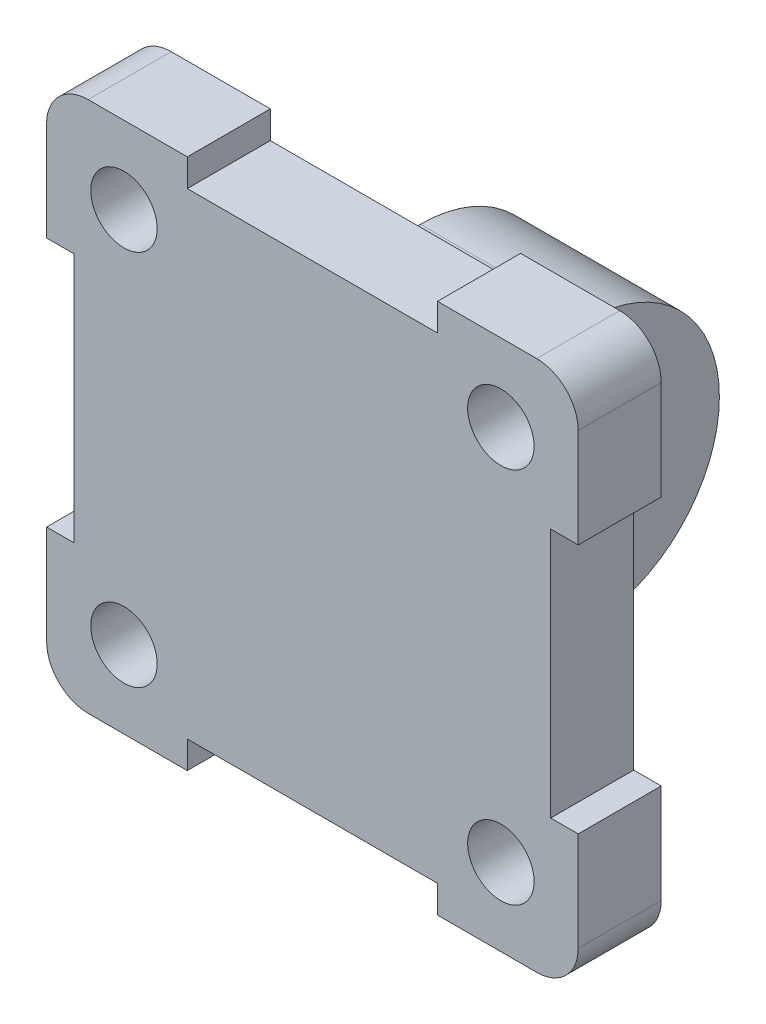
from build123d import *

# Parameters (mm, degrees)
SKETCH1_R           = 4
BOSS_EXTRUDE1_DEPTH = 10
SKETCH2_R           = 8
BOSS_EXTRUDE2_DEPTH = 10


with BuildPart() as part:
    # Sketch1 → Boss-Extrude1 (new body)
    with BuildSketch(Plane.XY):
        with BuildLine():
            Line((15.065, 32), (27, 32))
            ThreePointArc((27, 32), (30.535533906, 30.535533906), (32, 27))
            Line((32, 27), (32, 15.065))
            Line((32, 15.065), (28.69, 15.065))
            Line((28.69, 15.065), (28.69, -15.065))
            Line((28.69, -15.065), (32, -15.065))
            Line((32, -15.065), (32, -27))
            ThreePointArc((32, -27), (30.535533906, -30.535533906), (27, -32))
            Line((27, -32), (15.065, -32))
            Line((15.065, -32), (15.065, -28.69))
            Line((15.065, -28.69), (-15.065, -28.69))
            Line((-15.065, -28.69), (-15.065, -32))
            Line((-15.065, -32), (-27, -32))
            ThreePointArc((-27, -32), (-30.535533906, -30.535533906), (-32, -27))
            Line((-32, -27), (-32, -15.065))
            Line((-32, -15.065), (-28.69, -15.065))
            Line((-28.69, -15.065), (-28.69, 15.065))
            Line((-28.69, 15.065), (-32, 15.065))
            Line((-32, 15.065), (-32, 27))
            ThreePointArc((-32, 27), (-30.535533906, 30.535533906), (-27, 32))
            Line((-27, 32), (-15.065, 32))
            Line((-15.065, 32), (-15.065, 28.69))
            Line((-15.065, 28.69), (15.065, 28.69))
            Line((15.065, 28.69), (15.065, 32))
        make_face()
        with Locations((-22.69, 22.69)):
            Circle(SKETCH1_R, mode=Mode.SUBTRACT)
        with Locations((22.69, 22.69)):
            Circle(SKETCH1_R, mode=Mode.SUBTRACT)
        with Locations((22.69, -22.69)):
            Circle(SKETCH1_R, mode=Mode.SUBTRACT)
        with Locations((-22.69, -22.69)):
            Circle(SKETCH1_R, mode=Mode.SUBTRACT)
    extrude(amount=BOSS_EXTRUDE1_DEPTH)

    # Sketch2 → Boss-Extrude2 (add, symmetric)
    with BuildSketch(Plane(origin=(0, 0, 0), x_dir=(0, 0, -1), z_dir=(1, 0, 0))):
        with BuildLine():
            Line((0, 16), (13, 16))
            ThreePointArc((13, 16), (29, 0), (13, -16))
            Line((13, -16), (0, -16))
            Line((0, -16), (0, 16))
        make_face()
        with Locations((13, 0)):
            Circle(SKETCH2_R, mode=Mode.SUBTRACT)
    extrude(amount=BOSS_EXTRUDE2_DEPTH, both=True)


solid = part.part
